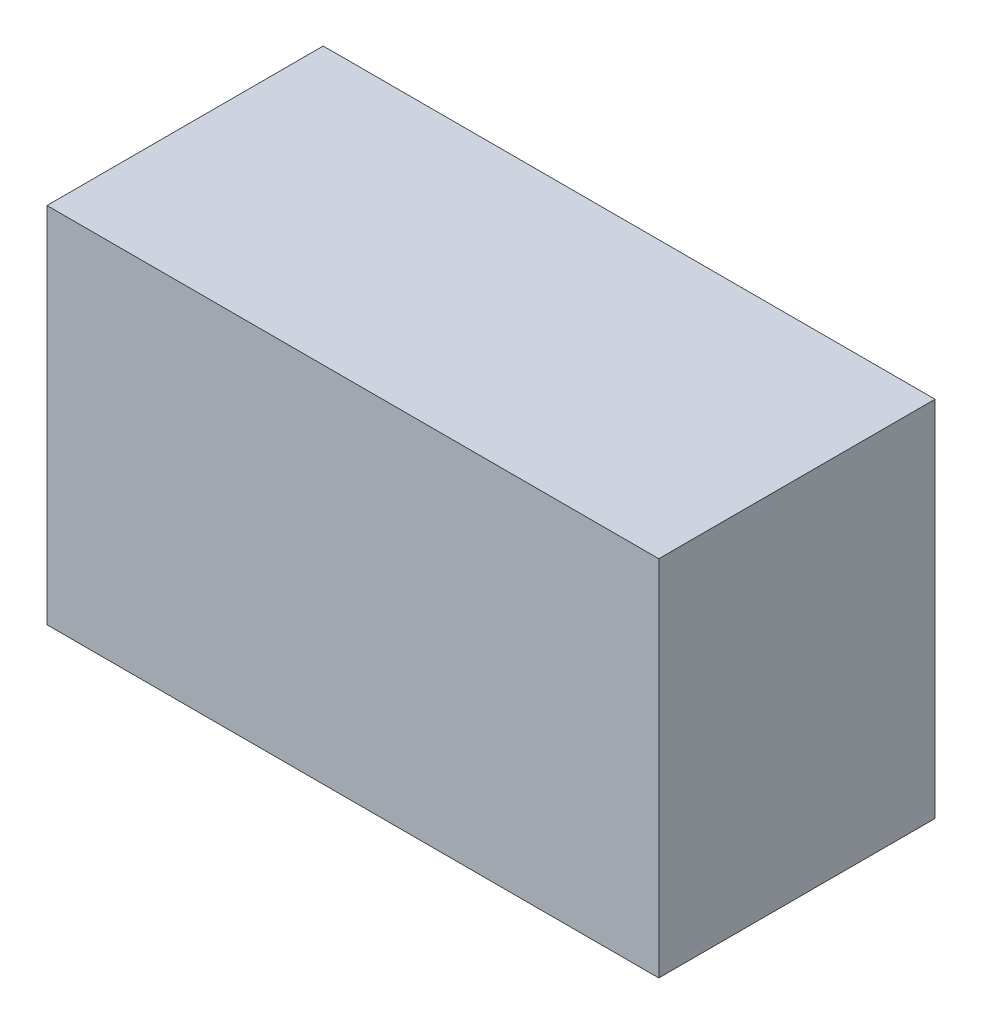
ISO-10303-21;
HEADER;
FILE_DESCRIPTION(('STEP AP214'),'2;1');
FILE_NAME('part.step','',(''),(''),'','','');
FILE_SCHEMA(('AUTOMOTIVE_DESIGN { 1 0 10303 214 1 1 1 1 }'));
ENDSEC;
DATA;
#1=APPLICATION_CONTEXT('core data for automotive mechanical design processes');
#2=APPLICATION_PROTOCOL_DEFINITION('international standard','automotive_design',2000,#1);
#3=PRODUCT_CONTEXT('',#1,'mechanical');
#4=PRODUCT('Part','Part','',(#3));
#5=PRODUCT_RELATED_PRODUCT_CATEGORY('part','',(#4));
#6=PRODUCT_DEFINITION_FORMATION('','',#4);
#7=PRODUCT_DEFINITION_CONTEXT('part definition',#1,'design');
#8=PRODUCT_DEFINITION('design','',#6,#7);
#9=PRODUCT_DEFINITION_SHAPE('','',#8);
#10=(LENGTH_UNIT() NAMED_UNIT(*) SI_UNIT(.MILLI.,.METRE.));
#11=(NAMED_UNIT(*) PLANE_ANGLE_UNIT() SI_UNIT($,.RADIAN.));
#12=(NAMED_UNIT(*) SI_UNIT($,.STERADIAN.) SOLID_ANGLE_UNIT());
#13=UNCERTAINTY_MEASURE_WITH_UNIT(LENGTH_MEASURE(1.E-05),#10,'distance_accuracy_value','');
#14=(GEOMETRIC_REPRESENTATION_CONTEXT(3) GLOBAL_UNCERTAINTY_ASSIGNED_CONTEXT((#13)) GLOBAL_UNIT_ASSIGNED_CONTEXT((#10,
#11,#12)) REPRESENTATION_CONTEXT('',''));
#15=CARTESIAN_POINT('',(0.,0.,0.));
#16=DIRECTION('',(0.,0.,1.));
#17=DIRECTION('',(1.,0.,0.));
#18=AXIS2_PLACEMENT_3D('',#15,#16,#17);
#19=CARTESIAN_POINT('',(-36.582296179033,17.4421918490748,34.29));
#20=DIRECTION('',(1.,0.,0.));
#21=DIRECTION('',(0.,0.,-1.));
#22=AXIS2_PLACEMENT_3D('',#19,#20,#21);
#23=PLANE('',#22);
#24=DIRECTION('',(0.,-1.,0.));
#25=VECTOR('',#24,1.);
#26=CARTESIAN_POINT('',(-36.582296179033,17.4421918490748,0.));
#27=LINE('',#26,#25);
#28=CARTESIAN_POINT('',(-36.582296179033,17.4421918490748,0.));
#29=VERTEX_POINT('',#28);
#30=CARTESIAN_POINT('',(-36.582296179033,-27.6296667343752,0.));
#31=VERTEX_POINT('',#30);
#32=EDGE_CURVE('E96',#29,#31,#27,.T.);
#33=ORIENTED_EDGE('',*,*,#32,.T.);
#34=DIRECTION('',(0.,0.,-1.));
#35=VECTOR('',#34,1.);
#36=CARTESIAN_POINT('',(-36.582296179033,-27.6296667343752,34.29));
#37=LINE('',#36,#35);
#38=CARTESIAN_POINT('',(-36.582296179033,-27.6296667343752,34.29));
#39=VERTEX_POINT('',#38);
#40=EDGE_CURVE('E11',#39,#31,#37,.T.);
#41=ORIENTED_EDGE('',*,*,#40,.F.);
#42=DIRECTION('',(0.,-1.,0.));
#43=VECTOR('',#42,1.);
#44=CARTESIAN_POINT('',(-36.582296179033,17.4421918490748,34.29));
#45=LINE('',#44,#43);
#46=CARTESIAN_POINT('',(-36.582296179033,17.4421918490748,34.29));
#47=VERTEX_POINT('',#46);
#48=EDGE_CURVE('E84',#47,#39,#45,.T.);
#49=ORIENTED_EDGE('',*,*,#48,.F.);
#50=DIRECTION('',(0.,0.,-1.));
#51=VECTOR('',#50,1.);
#52=CARTESIAN_POINT('',(-36.582296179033,17.4421918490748,34.29));
#53=LINE('',#52,#51);
#54=EDGE_CURVE('E92',#47,#29,#53,.T.);
#55=ORIENTED_EDGE('',*,*,#54,.T.);
#56=EDGE_LOOP('',(#33,#41,#49,#55));
#57=FACE_BOUND('',#56,.T.);
#58=ADVANCED_FACE('F33',(#57),#23,.F.);
#59=CARTESIAN_POINT('',(-36.582296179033,-27.6296667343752,34.29));
#60=DIRECTION('',(0.,1.,0.));
#61=DIRECTION('',(0.,0.,1.));
#62=AXIS2_PLACEMENT_3D('',#59,#60,#61);
#63=PLANE('',#62);
#64=DIRECTION('',(1.,0.,0.));
#65=VECTOR('',#64,1.);
#66=CARTESIAN_POINT('',(-36.582296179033,-27.6296667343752,0.));
#67=LINE('',#66,#65);
#68=CARTESIAN_POINT('',(39.3606984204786,-27.6296667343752,0.));
#69=VERTEX_POINT('',#68);
#70=EDGE_CURVE('E88',#31,#69,#67,.T.);
#71=ORIENTED_EDGE('',*,*,#70,.T.);
#72=DIRECTION('',(0.,0.,-1.));
#73=VECTOR('',#72,1.);
#74=CARTESIAN_POINT('',(39.3606984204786,-27.6296667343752,34.29));
#75=LINE('',#74,#73);
#76=CARTESIAN_POINT('',(39.3606984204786,-27.6296667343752,34.29));
#77=VERTEX_POINT('',#76);
#78=EDGE_CURVE('E41',#77,#69,#75,.T.);
#79=ORIENTED_EDGE('',*,*,#78,.F.);
#80=DIRECTION('',(1.,0.,0.));
#81=VECTOR('',#80,1.);
#82=CARTESIAN_POINT('',(-36.582296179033,-27.6296667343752,34.29));
#83=LINE('',#82,#81);
#84=EDGE_CURVE('E79',#39,#77,#83,.T.);
#85=ORIENTED_EDGE('',*,*,#84,.F.);
#86=ORIENTED_EDGE('',*,*,#40,.T.);
#87=EDGE_LOOP('',(#71,#79,#85,#86));
#88=FACE_BOUND('',#87,.T.);
#89=ADVANCED_FACE('F87',(#88),#63,.F.);
#90=CARTESIAN_POINT('',(39.3606984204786,17.4421918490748,34.29));
#91=DIRECTION('',(-1.,0.,0.));
#92=DIRECTION('',(0.,0.,1.));
#93=AXIS2_PLACEMENT_3D('',#90,#91,#92);
#94=PLANE('',#93);
#95=DIRECTION('',(0.,1.,0.));
#96=VECTOR('',#95,1.);
#97=CARTESIAN_POINT('',(39.3606984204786,17.4421918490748,0.));
#98=LINE('',#97,#96);
#99=CARTESIAN_POINT('',(39.3606984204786,17.4421918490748,0.));
#100=VERTEX_POINT('',#99);
#101=EDGE_CURVE('E66',#69,#100,#98,.T.);
#102=ORIENTED_EDGE('',*,*,#101,.T.);
#103=DIRECTION('',(0.,0.,-1.));
#104=VECTOR('',#103,1.);
#105=CARTESIAN_POINT('',(39.3606984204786,17.4421918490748,34.29));
#106=LINE('',#105,#104);
#107=CARTESIAN_POINT('',(39.3606984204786,17.4421918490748,34.29));
#108=VERTEX_POINT('',#107);
#109=EDGE_CURVE('E89',#108,#100,#106,.T.);
#110=ORIENTED_EDGE('',*,*,#109,.F.);
#111=DIRECTION('',(0.,1.,0.));
#112=VECTOR('',#111,1.);
#113=CARTESIAN_POINT('',(39.3606984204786,17.4421918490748,34.29));
#114=LINE('',#113,#112);
#115=EDGE_CURVE('E82',#77,#108,#114,.T.);
#116=ORIENTED_EDGE('',*,*,#115,.F.);
#117=ORIENTED_EDGE('',*,*,#78,.T.);
#118=EDGE_LOOP('',(#102,#110,#116,#117));
#119=FACE_BOUND('',#118,.T.);
#120=ADVANCED_FACE('F90',(#119),#94,.F.);
#121=CARTESIAN_POINT('',(-36.582296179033,17.4421918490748,34.29));
#122=DIRECTION('',(0.,-1.,0.));
#123=DIRECTION('',(0.,0.,-1.));
#124=AXIS2_PLACEMENT_3D('',#121,#122,#123);
#125=PLANE('',#124);
#126=DIRECTION('',(-1.,0.,0.));
#127=VECTOR('',#126,1.);
#128=CARTESIAN_POINT('',(-36.582296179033,17.4421918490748,0.));
#129=LINE('',#128,#127);
#130=EDGE_CURVE('E72',#100,#29,#129,.T.);
#131=ORIENTED_EDGE('',*,*,#130,.T.);
#132=ORIENTED_EDGE('',*,*,#54,.F.);
#133=DIRECTION('',(-1.,0.,0.));
#134=VECTOR('',#133,1.);
#135=CARTESIAN_POINT('',(-36.582296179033,17.4421918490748,34.29));
#136=LINE('',#135,#134);
#137=EDGE_CURVE('E49',#108,#47,#136,.T.);
#138=ORIENTED_EDGE('',*,*,#137,.F.);
#139=ORIENTED_EDGE('',*,*,#109,.T.);
#140=EDGE_LOOP('',(#131,#132,#138,#139));
#141=FACE_BOUND('',#140,.T.);
#142=ADVANCED_FACE('F103',(#141),#125,.F.);
#143=CARTESIAN_POINT('',(-36.582296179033,-27.6296667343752,34.29));
#144=DIRECTION('',(0.,0.,1.));
#145=DIRECTION('',(1.,0.,0.));
#146=AXIS2_PLACEMENT_3D('',#143,#144,#145);
#147=PLANE('',#146);
#148=ORIENTED_EDGE('',*,*,#48,.T.);
#149=ORIENTED_EDGE('',*,*,#84,.T.);
#150=ORIENTED_EDGE('',*,*,#115,.T.);
#151=ORIENTED_EDGE('',*,*,#137,.T.);
#152=EDGE_LOOP('',(#148,#149,#150,#151));
#153=FACE_BOUND('',#152,.T.);
#154=ADVANCED_FACE('F80',(#153),#147,.T.);
#155=CARTESIAN_POINT('',(-36.582296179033,-27.6296667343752,0.));
#156=DIRECTION('',(0.,0.,1.));
#157=DIRECTION('',(1.,0.,0.));
#158=AXIS2_PLACEMENT_3D('',#155,#156,#157);
#159=PLANE('',#158);
#160=ORIENTED_EDGE('',*,*,#32,.F.);
#161=ORIENTED_EDGE('',*,*,#130,.F.);
#162=ORIENTED_EDGE('',*,*,#101,.F.);
#163=ORIENTED_EDGE('',*,*,#70,.F.);
#164=EDGE_LOOP('',(#160,#161,#162,#163));
#165=FACE_BOUND('',#164,.T.);
#166=ADVANCED_FACE('F106',(#165),#159,.F.);
#167=CLOSED_SHELL('',(#58,#89,#120,#142,#154,#166));
#168=MANIFOLD_SOLID_BREP('B2',#167);
#169=ADVANCED_BREP_SHAPE_REPRESENTATION('',(#18,#168),#14);
#170=SHAPE_DEFINITION_REPRESENTATION(#9,#169);
ENDSEC;
END-ISO-10303-21;
